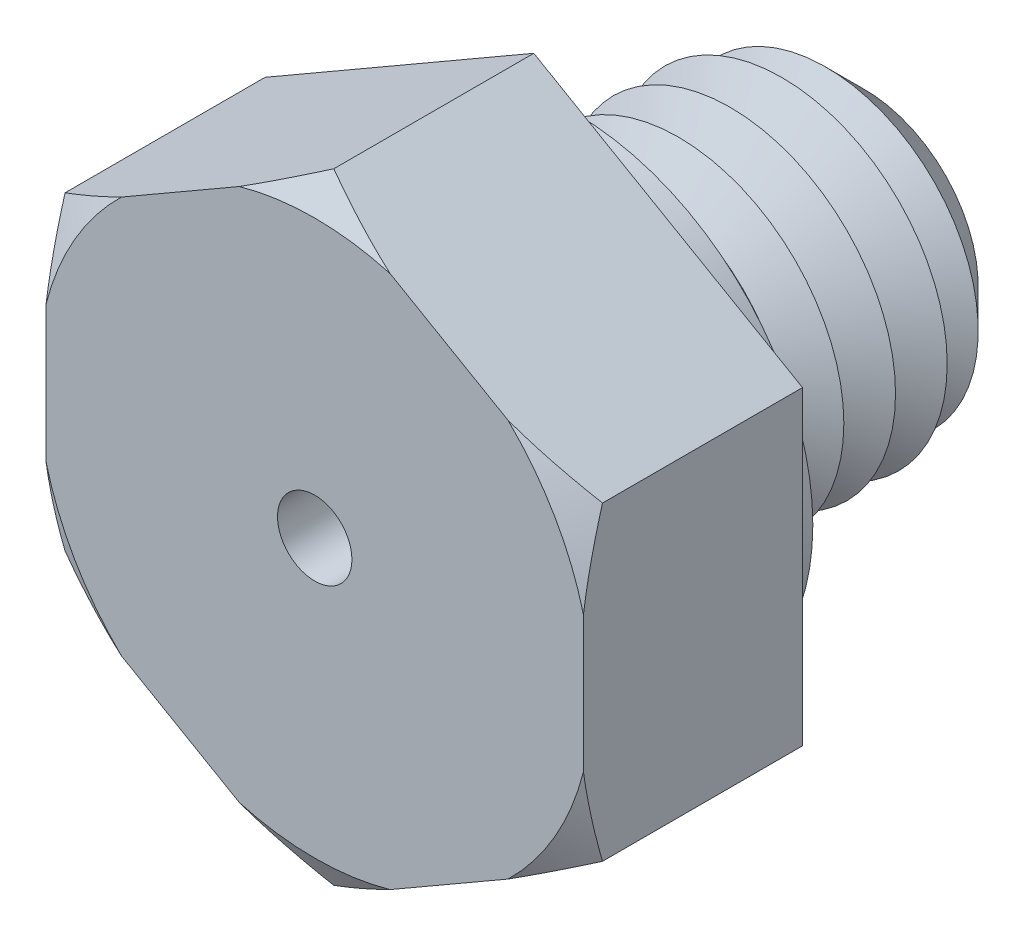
from build123d import *

# Parameters (mm, degrees)
BOSS_EXTRUDE1_DEPTH = 5.3
SKETCH3_R           = 4
BOSS_EXTRUDE2_DEPTH = 8
SKETCH4_R           = 5.75
BOSS_EXTRUDE3_DEPTH = 1
CHAMFER1_SIZE       = 1.25
LPATTERN1_COUNT     = 5
LPATTERN1_PITCH     = 1.25
SKETCH8_R           = 0.9
CUT_EXTRUDE1_DEPTH  = 13.3


with BuildPart() as part:
    # Sketch2 → Boss-Extrude1 (new body)
    with BuildSketch(Plane.XY):
        Polygon((0, 7.505553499), (-6.5, 3.75277675), (-6.5, -3.75277675), (0, -7.505553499), (6.5, -3.75277675), (6.5, 3.75277675), align=None)
    extrude(amount=BOSS_EXTRUDE1_DEPTH)

    # Sketch3 → Boss-Extrude2 (add)
    with BuildSketch(Plane(origin=(0, 0, 0), x_dir=(-1, 0, 0), z_dir=(0, 0, -1))):
        Circle(SKETCH3_R)
    extrude(amount=BOSS_EXTRUDE2_DEPTH)

    # Sketch4 → Boss-Extrude3 (add)
    with BuildSketch(Plane(origin=(0, 0, 0), x_dir=(-1, 0, 0), z_dir=(0, 0, -1))):
        with Locations(Location((0, 0, 0), (0, 0, 180))):
            Circle(SKETCH4_R)
    extrude(amount=BOSS_EXTRUDE3_DEPTH)

    # Chamfer1
    chamfer1_edges = [part.edges().sort_by_distance(p)[0] for p in [
        (4, 0, -8),
    ]]
    chamfer(chamfer1_edges, length=CHAMFER1_SIZE)

    # Sketch6 → Cut-Revolve1 (revolve, cut)
    with BuildSketch(Plane(origin=(0, 0, 0), x_dir=(0, 0, -1), z_dir=(1, 0, 0)), mode=Mode.PRIVATE) as cut_revolve1_sk:
        Polygon((1, 4), (1.625, 2.917468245), (2.25, 4), align=None)
    cut_revolve1 = revolve(cut_revolve1_sk.sketch.rotate(Axis((0, 0, 3.211670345), (0, 0, -1)), 90), axis=Axis((0, 0, 3.211670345), (0, 0, -1)), mode=Mode.SUBTRACT)

    # LPattern1: Cut-Revolve1 ×5
    with Locations(*[(0, 0, -i * LPATTERN1_PITCH) for i in range(1, LPATTERN1_COUNT)]):
        add(cut_revolve1, mode=Mode.SUBTRACT)

    # Sketch7 → Cut-Revolve2 (revolve, cut)
    with BuildSketch(Plane(origin=(0, 0, 0), x_dir=(0, 0, -1), z_dir=(1, 0, 0)), mode=Mode.PRIVATE) as cut_revolve2_sk:
        Polygon((-5.3, 7.505553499), (-5.3, 6.705553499), (-4.838119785, 7.505553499), align=None)
    revolve(cut_revolve2_sk.sketch.rotate(Axis((0, 0, 3.211670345), (0, 0, -1)), 270), axis=Axis((0, 0, 3.211670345), (0, 0, -1)), mode=Mode.SUBTRACT)

    # Sketch8 → Cut-Extrude1 (cut)
    with BuildSketch(Plane.XY.offset(5.3)):
        Circle(SKETCH8_R)
    extrude(amount=-CUT_EXTRUDE1_DEPTH, mode=Mode.SUBTRACT)


solid = part.part
